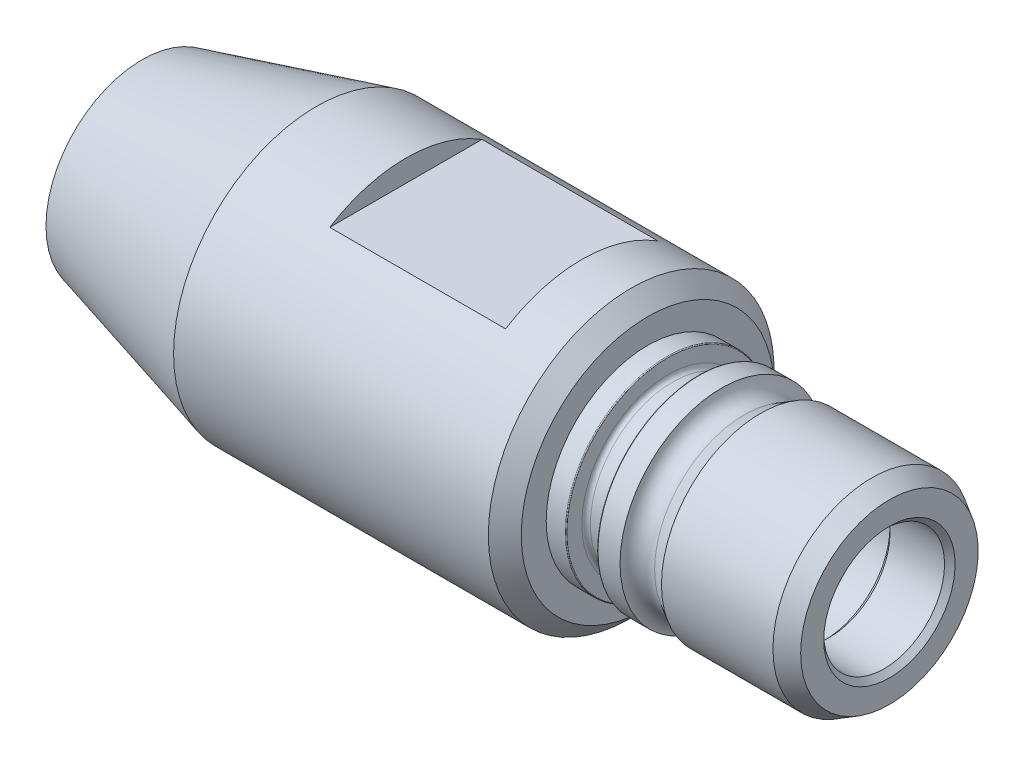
from build123d import *

# Parameters (mm, degrees)
F_3_4_16_TAPPED_HOLE1_D     = 17.4498
F_3_4_16_TAPPED_HOLE1_DEPTH = 25.4
F_3_4_16_TAPPED_HOLE1_TIP   = 5.242448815
F_3_4_16_TAPPED_HOLE2_D     = 17.4498
F_3_4_16_TAPPED_HOLE2_DEPTH = 9.398
F_3_4_16_TAPPED_HOLE2_TIP   = 5.242448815
CHAMFER1_SIZE               = 0.762
CHAMFER2_SIZE               = 0.762
CHAMFER3_SIZE               = 0.762
CHAMFER3_SIZE2              = 0.277345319
CUT_EXTRUDE1_DEPTH          = 112.825825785
CUT_EXTRUDE1_DEPTH_BACK     = 112.825825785
SKETCH9_W                   = 25.4
SKETCH9_H                   = 9.110540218
SKETCH9_H_2                 = 7.842271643
FILLET1_R                   = 0.635


with BuildPart() as part:
    # Sketch1 → Revolve1 (revolve)
    with BuildSketch(Plane.XY, mode=Mode.PRIVATE) as revolve1_sk:
        with BuildLine():
            Line((0, 0), (0, 13.890625))
            Line((0, 13.890625), (25.179680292, 20.6375))
            Line((25.179680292, 20.6375), (73.025, 20.6375))
            Line((73.025, 20.6375), (73.025, 14.6558))
            Line((73.025, 14.6558), (75.785864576, 14.6558))
            ThreePointArc((75.785864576, 14.6558), (75.873686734, 14.620540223), (75.9127437, 14.534339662))
            Line((75.9127437, 14.534339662), (76.001804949, 12.494501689))
            ThreePointArc((76.001804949, 12.494501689), (76.197089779, 12.063498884), (76.63620057, 11.8872))
            Line((76.63620057, 11.8872), (79.662240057, 11.8872))
            ThreePointArc((79.662240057, 11.8872), (80.101350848, 12.063498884), (80.296635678, 12.494501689))
            Line((80.296635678, 12.494501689), (80.385696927, 14.534339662))
            ThreePointArc((80.385696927, 14.534339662), (80.424753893, 14.620540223), (80.512576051, 14.6558))
            Line((80.512576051, 14.6558), (83.693, 14.6558))
            ThreePointArc((83.693, 14.6558), (84.889573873, 12.963475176), (86.96198, 12.93372305))
            Line((86.96198, 12.93372305), (89.30679046, 14.2875))
            Line((89.30679046, 14.2875), (107.95, 14.2875))
            Line((107.95, 14.2875), (107.95, 0))
            Line((107.95, 0), (0, 0))
        make_face()
    revolve(revolve1_sk.sketch.rotate(Axis((0, 0, 0), (1, 0, 0)), 90), axis=Axis((0, 0, 0), (1, 0, 0)))

    # Sketch2 → Cut-Revolve3 (revolve, cut)
    with BuildSketch(Plane.XY, mode=Mode.PRIVATE) as cut_revolve3_sk:
        Polygon((69.035894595, 22.245355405), (73.025, 18.25625), (73.025, 22.245355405), align=None)
        Polygon((105.41, 14.2875), (107.95, 12.821030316), (107.95, 14.2875), align=None)
    revolve(cut_revolve3_sk.sketch.rotate(Axis((73.025, 0, 0), (1, 0, 0)), 90), axis=Axis((73.025, 0, 0), (1, 0, 0)), mode=Mode.SUBTRACT)

    # Sketch3 → Cut-Revolve4 (revolve, cut)
    with BuildSketch(Plane.XY, mode=Mode.PRIVATE) as cut_revolve4_sk:
        Polygon((30.9372, 7.1374), (34.1122, 7.1374), (34.1122, 0), (0, 0), (0, 8.7249), (30.9372, 8.7249), align=None)
    revolve(cut_revolve4_sk.sketch.rotate(Axis((0, 0, 0), (1, 0, 0)), 90), axis=Axis((0, 0, 0), (1, 0, 0)), mode=Mode.SUBTRACT)

    # 3_4-16 Tapped Hole1
    with Locations(Plane.ZY):
        with Locations((0, 0)):
            Hole(F_3_4_16_TAPPED_HOLE1_D / 2, depth=F_3_4_16_TAPPED_HOLE1_DEPTH)
            with Locations((0, 0, -(F_3_4_16_TAPPED_HOLE1_DEPTH + F_3_4_16_TAPPED_HOLE1_TIP / 2))):  # 118° drill point
                Cone(0, F_3_4_16_TAPPED_HOLE1_D / 2, F_3_4_16_TAPPED_HOLE1_TIP, mode=Mode.SUBTRACT)

    # 3_4-16 Tapped Hole2
    with Locations(Plane(origin=(107.95, 0, 0), x_dir=(0, 0, -1), z_dir=(1, 0, 0))):
        with Locations((0, 0)):
            Hole(F_3_4_16_TAPPED_HOLE2_D / 2, depth=F_3_4_16_TAPPED_HOLE2_DEPTH)
            with Locations((0, 0, -(F_3_4_16_TAPPED_HOLE2_DEPTH + F_3_4_16_TAPPED_HOLE2_TIP / 2))):  # 118° drill point
                Cone(0, F_3_4_16_TAPPED_HOLE2_D / 2, F_3_4_16_TAPPED_HOLE2_TIP, mode=Mode.SUBTRACT)

    # Sketch8 → Cut-Revolve6 (revolve, cut)
    with BuildSketch(Plane.XY, mode=Mode.PRIVATE) as cut_revolve6_sk:
        with BuildLine():
            Line((93.726, 6.3373), (93.726, 8.89))
            ThreePointArc((93.726, 8.89), (93.949184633, 9.428815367), (94.488, 9.652))
            Line((94.488, 9.652), (98.552, 9.652))
            Line((98.552, 9.652), (98.552, 0))
            Line((98.552, 0), (34.1122, 0))
            Line((34.1122, 0), (34.1122, 4.3561))
            Line((34.1122, 4.3561), (68.326, 4.3561))
            Line((68.326, 4.3561), (68.326, 5.5753))
            Line((68.326, 5.5753), (92.964, 5.5753))
            Line((92.964, 5.5753), (93.726, 6.3373))
        make_face()
    revolve(cut_revolve6_sk.sketch.rotate(Axis((107.95, 0, 0), (-1, 0, 0)), 90), axis=Axis((107.95, 0, 0), (-1, 0, 0)), mode=Mode.SUBTRACT)

    # Chamfer1
    chamfer1_edges = [part.edges().sort_by_distance(p)[0] for p in [
        (107.95, 0, -8.7249),
    ]]
    chamfer(chamfer1_edges, length=CHAMFER1_SIZE)

    # Chamfer2
    chamfer2_edges = [part.edges().sort_by_distance(p)[0] for p in [
        (98.552, 0, -8.7249),
    ]]
    chamfer(chamfer2_edges, length=CHAMFER2_SIZE)

    # Chamfer3
    chamfer3_edges = [part.edges().sort_by_distance(p)[0] for p in [
        (30.9372, 0, -7.1374),
    ]]
    chamfer3_side = [part.faces().sort_by_distance(p)[0] for p in [
        (32.5247, 0, -7.1374),
    ]]
    chamfer(chamfer3_edges, length=CHAMFER3_SIZE, length2=CHAMFER3_SIZE2, reference=chamfer3_side[0])

    # Sketch9 → Cut-Extrude1 (cut, two sides: drawn at the far end of the back side and taken through both)
    with BuildSketch(Plane.XY.offset(-CUT_EXTRUDE1_DEPTH_BACK)):
        with Locations((50.8, 22.017770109)):
            Rectangle(SKETCH9_W, SKETCH9_H)
        with Locations((50.8, -21.383635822)):
            Rectangle(SKETCH9_W, SKETCH9_H_2)
    extrude(amount=CUT_EXTRUDE1_DEPTH + CUT_EXTRUDE1_DEPTH_BACK, mode=Mode.SUBTRACT)

    # Fillet1
    fillet1_edges = [part.edges().sort_by_distance(p)[0] for p in [
        (34.1122, 0, -7.1374),
    ]]
    fillet(fillet1_edges, radius=FILLET1_R)


solid = part.part
